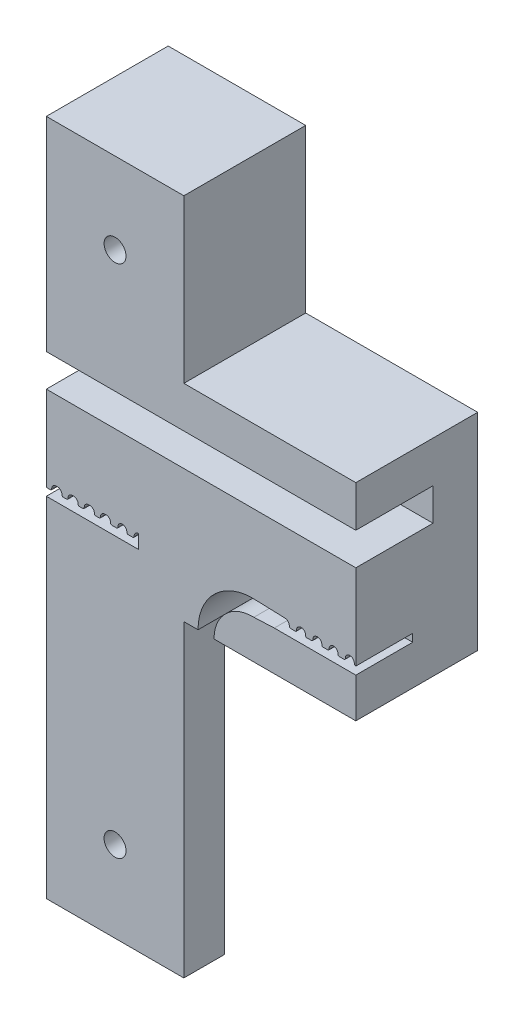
from build123d import *

# Parameters (mm, degrees)
SKETCH1_W           = 50.8
SKETCH1_H           = 25.4
BOSS_EXTRUDE1_DEPTH = 12.46
SKETCH4_W           = 38.1
SKETCH4_H           = 25.4
BOSS_EXTRUDE2_DEPTH = 44.45
SKETCH5_W           = 26.67
SKETCH5_H           = 26.67
CUT_EXTRUDE1_DEPTH  = 19.05
SKETCH7_R           = 3.429
CUT_EXTRUDE2_DEPTH  = 66.16755788
SKETCH10_W          = 7.5
SKETCH10_H          = 4
CUT_EXTRUDE3_DEPTH  = 78.334844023
CUT_EXTRUDE4_DEPTH  = 7
SKETCH11_W          = 50.8
SKETCH11_H          = 25.4
BOSS_EXTRUDE3_DEPTH = 2.54
SKETCH12_R          = 2.54
CUT_EXTRUDE5_DEPTH  = 7.62
SKETCH13_W          = 44.45
SKETCH13_H          = 25.4
CUT_EXTRUDE6_DEPTH  = 74.320124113
SKETCH15_W          = 7
SKETCH15_H          = 0.960001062
CUT_EXTRUDE8_DEPTH  = 10
SKETCH16_W          = 29.63
SKETCH16_H          = 15
BOSS_EXTRUDE4_DEPTH = 20
SKETCH17_W          = 29.625229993
SKETCH17_H          = 5
BOSS_EXTRUDE5_DEPTH = 38
SKETCH27_W          = 12.7
SKETCH27_H          = 83.4
CUT_EXTRUDE12_DEPTH = 59.657054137
SKETCH31_R          = 1.35
CUT_EXTRUDE13_DEPTH = 59.657054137
SKETCH36_W          = 2
SKETCH36_H          = 4
CUT_EXTRUDE16_DEPTH = 65.632434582


with BuildPart() as part:
    # Sketch1 → Boss-Extrude1 (new body)
    with BuildSketch(Plane.XY):
        Rectangle(SKETCH1_W, SKETCH1_H)
    extrude(amount=BOSS_EXTRUDE1_DEPTH)

    # Sketch4 → Boss-Extrude2 (add)
    with BuildSketch(Plane.XY.offset(12.46)):
        Rectangle(SKETCH4_W, SKETCH4_H)
    extrude(amount=BOSS_EXTRUDE2_DEPTH)

    # Sketch5 → Cut-Extrude1 (cut)
    with BuildSketch(Plane(origin=(0, 12.7, 0), x_dir=(1, 0, 0), z_dir=(0, 1, 0))):
        with Locations((0, -31.51)):
            Rectangle(SKETCH5_W, SKETCH5_H)
    extrude(amount=-CUT_EXTRUDE1_DEPTH, mode=Mode.SUBTRACT)

    # Sketch7 → Cut-Extrude2 (cut, through all)
    with BuildSketch(Plane(origin=(0, -6.35, 0), x_dir=(1, 0, 0), z_dir=(0, 1, 0))):
        with Locations(Location((0, -31.51, 0), (0, 0, 270))):
            Circle(SKETCH7_R)
    extrude(amount=-CUT_EXTRUDE2_DEPTH, mode=Mode.SUBTRACT)

    # Sketch10 → Cut-Extrude3 (cut, through all)
    with BuildSketch(Plane(origin=(25.4, 0, 0), x_dir=(0, 0, -1), z_dir=(1, 0, 0))):
        with Locations((-8.71, 5.62)):
            Rectangle(SKETCH10_W, SKETCH10_H)
    extrude(amount=-CUT_EXTRUDE3_DEPTH, mode=Mode.SUBTRACT)

    # Sketch3 → Cut-Extrude4 (cut)
    with BuildSketch(Plane.XY.offset(12.46)):
        with BuildLine():
            Line((-23.465217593, -6.100002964), (-23.459057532, -6.100002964))
            ThreePointArc((-23.459057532, -6.100002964), (-23.066643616, -6.262529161), (-22.904059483, -6.654919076))
            ThreePointArc((-22.904059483, -6.654919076), (-22.904499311, -6.67711383), (-22.905750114, -6.698298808))
            ThreePointArc((-22.905750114, -6.698298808), (-22.866332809, -6.811845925), (-22.75620684, -6.860001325))
            Line((-22.75620684, -6.860001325), (-22.164999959, -6.86000102))
            ThreePointArc((-22.164999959, -6.86000102), (-22.058933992, -6.81606701), (-22.015000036, -6.71000102))
            Line((-22.015000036, -6.71000102), (-22.015000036, -6.622637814))
            Line((-22.015000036, -6.622637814), (-22.013115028, -6.622637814))
            ThreePointArc((-22.013115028, -6.622637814), (-21.842134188, -6.253375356), (-21.465217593, -6.100002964))
            Line((-21.465217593, -6.100002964), (-21.459057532, -6.100002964))
            ThreePointArc((-21.459057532, -6.100002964), (-21.066642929, -6.262529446), (-20.904058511, -6.654920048))
            ThreePointArc((-20.904058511, -6.654920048), (-20.90449834, -6.67711484), (-20.905749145, -6.698299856))
            ThreePointArc((-20.905749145, -6.698299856), (-20.86633184, -6.811846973), (-20.75620587, -6.860002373))
            Line((-20.75620587, -6.860002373), (-20.16499899, -6.860002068))
            ThreePointArc((-20.16499899, -6.860002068), (-20.058933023, -6.816068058), (-20.014999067, -6.710002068))
            Line((-20.014999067, -6.710002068), (-20.014999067, -6.622634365))
            Line((-20.014999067, -6.622634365), (-20.013115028, -6.622634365))
            ThreePointArc((-20.013115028, -6.622634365), (-19.84221677, -6.253450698), (-19.465445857, -6.100002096))
            Line((-19.465445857, -6.100002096), (-19.459135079, -6.100002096))
            ThreePointArc((-19.459135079, -6.100002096), (-19.066692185, -6.262557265), (-18.904137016, -6.655000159))
            ThreePointArc((-18.904137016, -6.655000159), (-18.904579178, -6.677171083), (-18.905830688, -6.698336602))
            ThreePointArc((-18.905830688, -6.698336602), (-18.866421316, -6.811886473), (-18.75629871, -6.860049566))
            Line((-18.75629871, -6.860049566), (-18.165091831, -6.860090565))
            ThreePointArc((-18.165091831, -6.860090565), (-18.059022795, -6.816163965), (-18.015081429, -6.710101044))
            Line((-18.015081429, -6.710101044), (-18.015075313, -6.622558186))
            Line((-18.015075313, -6.622558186), (-18.013188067, -6.622558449))
            ThreePointArc((-18.013188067, -6.622558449), (-17.842155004, -6.253321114), (-17.465217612, -6.100002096))
            Line((-17.465217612, -6.100002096), (-17.459058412, -6.100002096))
            ThreePointArc((-17.459058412, -6.100002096), (-17.0666432, -6.262528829), (-16.90405853, -6.654920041))
            ThreePointArc((-16.90405853, -6.654920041), (-16.904479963, -6.67662649), (-16.905750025, -6.698299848))
            ThreePointArc((-16.905750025, -6.698299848), (-16.86633272, -6.811846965), (-16.75620675, -6.860002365))
            Line((-16.75620675, -6.860002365), (-16.164999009, -6.86000206))
            ThreePointArc((-16.164999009, -6.86000206), (-16.058933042, -6.81606805), (-16.014999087, -6.71000206))
            Line((-16.014999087, -6.71000206), (-16.014999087, -6.62264054))
            Line((-16.014999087, -6.62264054), (-16.013113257, -6.62264054))
            ThreePointArc((-16.013113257, -6.62264054), (-15.842132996, -6.253377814), (-15.465215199, -6.100356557))
            Line((-15.465215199, -6.100356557), (-15.465215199, -7.800353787))
            Line((-15.465215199, -7.800353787), (-25.439272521, -7.800353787))
            Line((-25.439272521, -7.800353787), (-25.439272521, -6.100353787))
            ThreePointArc((-25.439272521, -6.100353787), (-25.059708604, -6.269585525), (-24.904058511, -6.654918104))
            ThreePointArc((-24.904058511, -6.654918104), (-24.90449834, -6.677112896), (-24.905749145, -6.698297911))
            ThreePointArc((-24.905749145, -6.698297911), (-24.86633184, -6.811845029), (-24.75620587, -6.860000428))
            Line((-24.75620587, -6.860000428), (-24.16499899, -6.860000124))
            ThreePointArc((-24.16499899, -6.860000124), (-24.058933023, -6.816066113), (-24.014999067, -6.710000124))
            Line((-24.014999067, -6.710000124), (-24.014999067, -6.622637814))
            Line((-24.014999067, -6.622637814), (-24.013115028, -6.622637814))
            ThreePointArc((-24.013115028, -6.622637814), (-23.842134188, -6.253375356), (-23.465217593, -6.100002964))
        make_face()
        with BuildLine():
            Line((18.659057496, -6.1), (18.665217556, -6.1))
            ThreePointArc((18.665217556, -6.1), (19.042134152, -6.253372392), (19.213114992, -6.62263485))
            Line((19.213114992, -6.62263485), (19.215, -6.62263485))
            Line((19.215, -6.62263485), (19.215, -6.71))
            ThreePointArc((19.215, -6.71), (19.258934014, -6.816066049), (19.36500009, -6.86000113))
            Line((19.36500009, -6.86000113), (19.95620697, -6.860001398))
            ThreePointArc((19.95620697, -6.860001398), (20.066333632, -6.811845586), (20.105750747, -6.698297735))
            ThreePointArc((20.105750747, -6.698297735), (20.104480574, -6.676624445), (20.104059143, -6.654918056))
            ThreePointArc((20.104059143, -6.654918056), (20.266642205, -6.262526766), (20.659057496, -6.1))
            Line((20.659057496, -6.1), (20.665218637, -6.1))
            ThreePointArc((20.665218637, -6.1), (21.042151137, -6.253364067), (21.213140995, -6.622635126))
            Line((21.213140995, -6.622635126), (21.215026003, -6.622635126))
            Line((21.215026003, -6.622635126), (21.215026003, -6.710000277))
            ThreePointArc((21.215026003, -6.710000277), (21.258959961, -6.81606627), (21.365025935, -6.860002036))
            Line((21.365025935, -6.860002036), (21.956207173, -6.860002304))
            ThreePointArc((21.956207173, -6.860002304), (22.066334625, -6.81184625), (22.105749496, -6.698297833))
            ThreePointArc((22.105749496, -6.698297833), (22.104480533, -6.67666545), (22.104057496, -6.655))
            ThreePointArc((22.104057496, -6.655), (22.266613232, -6.262555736), (22.659057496, -6.1))
            Line((22.659057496, -6.1), (22.665193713, -6.1))
            ThreePointArc((22.665193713, -6.1), (23.042126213, -6.253364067), (23.213116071, -6.622635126))
            Line((23.213116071, -6.622635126), (23.215001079, -6.622635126))
            Line((23.215001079, -6.622635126), (23.215001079, -6.710000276))
            ThreePointArc((23.215001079, -6.710000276), (23.258935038, -6.816066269), (23.365001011, -6.860002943))
            Line((23.365001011, -6.860002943), (23.956207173, -6.86000321))
            ThreePointArc((23.956207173, -6.86000321), (24.066335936, -6.811846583), (24.10575146, -6.6982968))
            ThreePointArc((24.10575146, -6.6982968), (24.104483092, -6.67666447), (24.104060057, -6.65499912))
            ThreePointArc((24.104060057, -6.65499912), (24.266613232, -6.262554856), (24.659057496, -6.09999912))
            Line((24.659057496, -6.09999912), (24.665217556, -6.09999912))
            ThreePointArc((24.665217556, -6.09999912), (25.042134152, -6.253371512), (25.213114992, -6.62263397))
            Line((25.213114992, -6.62263397), (25.215000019, -6.62263397))
            Line((25.215000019, -6.62263397), (25.215000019, -6.70999912))
            ThreePointArc((25.215000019, -6.70999912), (25.258934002, -6.816065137), (25.365000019, -6.85999912))
            Line((25.365000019, -6.85999912), (25.365000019, -7.820000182))
            Line((25.365000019, -7.820000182), (15.365027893, -7.820000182))
            Line((15.365027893, -7.820000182), (12.850451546, -7.931024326))
            ThreePointArc((12.850451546, -7.931024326), (9.389006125, -9.278525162), (7.943023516, -12.700001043))
            Line((7.943023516, -12.700001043), (5.975229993, -12.700001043))
            ThreePointArc((5.975229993, -12.700001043), (8.144632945, -7.747052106), (13.256046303, -5.983117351))
            Line((13.256046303, -5.983117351), (16.679806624, -6.10035381))
            ThreePointArc((16.679806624, -6.10035381), (17.04738086, -6.258443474), (17.213114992, -6.62263485))
            Line((17.213114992, -6.62263485), (17.215, -6.62263485))
            Line((17.215, -6.62263485), (17.215, -6.71))
            ThreePointArc((17.215, -6.71), (17.258933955, -6.81606599), (17.364999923, -6.859998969))
            Line((17.364999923, -6.859998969), (17.956206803, -6.859999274))
            ThreePointArc((17.956206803, -6.859999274), (18.066332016, -6.811844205), (18.105749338, -6.698297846))
            ThreePointArc((18.105749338, -6.698297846), (18.104479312, -6.676624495), (18.10405788, -6.654918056))
            ThreePointArc((18.10405788, -6.654918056), (18.266642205, -6.262526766), (18.659057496, -6.1))
        make_face()
    cut_extrude4 = extrude(amount=-CUT_EXTRUDE4_DEPTH, mode=Mode.SUBTRACT)

    # Sketch11 → Boss-Extrude3 (add)
    with BuildSketch(Plane(origin=(0, 0, 0), x_dir=(-1, 0, 0), z_dir=(0, 0, -1))):
        Rectangle(SKETCH11_W, SKETCH11_H)
    extrude(amount=BOSS_EXTRUDE3_DEPTH)

    # Sketch12 → Cut-Extrude5 (cut)
    with BuildSketch(Plane.XY.offset(56.91)):
        Circle(SKETCH12_R)
    extrude(amount=-CUT_EXTRUDE5_DEPTH, mode=Mode.SUBTRACT)

    # Sketch13 → Cut-Extrude6 (cut, through all)
    with BuildSketch(Plane.ZY.offset(19.05)):
        with Locations((34.685, 0)):
            Rectangle(SKETCH13_W, SKETCH13_H)
    extrude(amount=-CUT_EXTRUDE6_DEPTH, mode=Mode.SUBTRACT)

    # Sketch15 → Cut-Extrude8 (cut)
    with BuildSketch(Plane.ZY.offset(-25.365000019)):
        with Locations((8.96, -7.339999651)):
            Rectangle(SKETCH15_W, SKETCH15_H)
    extrude(amount=-CUT_EXTRUDE8_DEPTH, mode=Mode.SUBTRACT)

    # Sketch16 → Boss-Extrude4 (add)
    with BuildSketch(Plane(origin=(0, 12.7, 0), x_dir=(1, 0, 0), z_dir=(0, 1, 0))):
        with Locations((-10.585, -4.96)):
            Rectangle(SKETCH16_W, SKETCH16_H)
    extrude(amount=BOSS_EXTRUDE4_DEPTH)

    # Sketch17 → Boss-Extrude5 (add)
    with BuildSketch(Plane.XZ.offset(12.7)):
        with Locations((-10.587385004, 9.96)):
            Rectangle(SKETCH17_W, SKETCH17_H)
    extrude(amount=BOSS_EXTRUDE5_DEPTH)

    # Mirror1: Cut-Extrude4 across plane
    add(cut_extrude4.mirror(Plane.ZY.offset(15.47)), mode=Mode.SUBTRACT)

    # Mirror2: Cut-Extrude4 across plane
    add(cut_extrude4.mirror(Plane.ZY.offset(13.4)), mode=Mode.SUBTRACT)

    # Sketch27 → Cut-Extrude12 (cut, through all)
    with BuildSketch(Plane.XY.offset(12.46)):
        with Locations((-19.05, -9)):
            Rectangle(SKETCH27_W, SKETCH27_H)
    extrude(amount=-CUT_EXTRUDE12_DEPTH, mode=Mode.SUBTRACT)

    # Sketch31 → Cut-Extrude13 (cut, through all)
    with BuildSketch(Plane.XY.offset(12.46)):
        with Locations((-4.24, 22.7)):
            Circle(SKETCH31_R)
        with Locations((-4.24, -40.7)):
            Circle(SKETCH31_R)
    extrude(amount=-CUT_EXTRUDE13_DEPTH, mode=Mode.SUBTRACT)

    # Sketch36 → Cut-Extrude16 (cut, through all)
    with BuildSketch(Plane(origin=(25.4, 0, 0), x_dir=(0, 0, -1), z_dir=(1, 0, 0))):
        with Locations((-3.96, 5.62)):
            Rectangle(SKETCH36_W, SKETCH36_H)
    extrude(amount=-CUT_EXTRUDE16_DEPTH, mode=Mode.SUBTRACT)


solid = part.part
